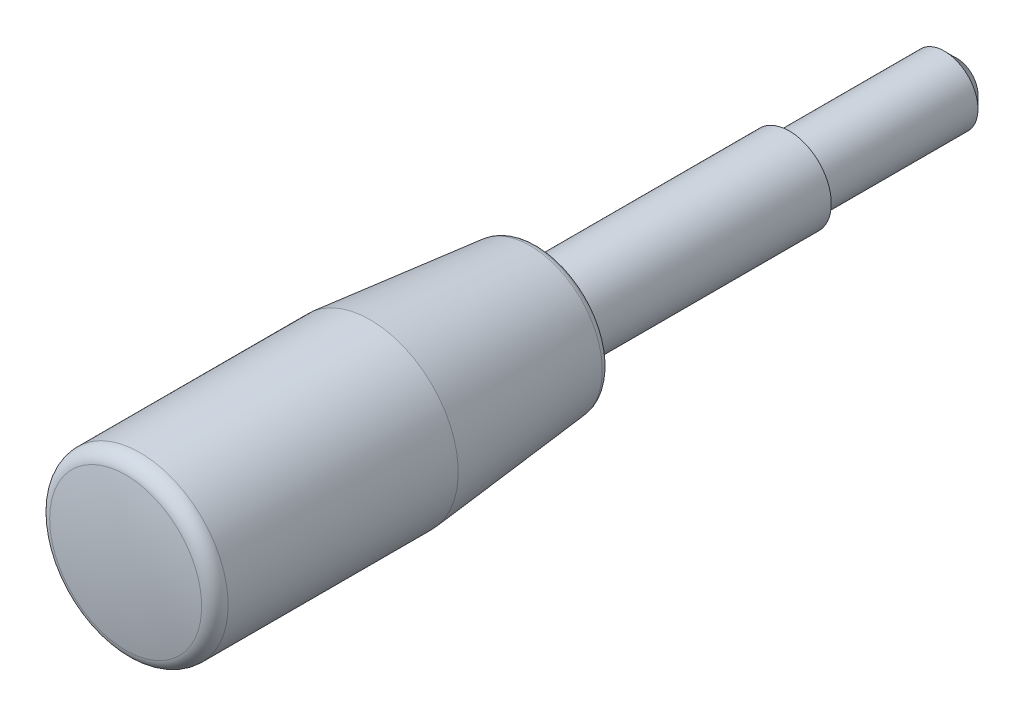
ISO-10303-21;
HEADER;
FILE_DESCRIPTION(('STEP AP214'),'2;1');
FILE_NAME('part.step','',(''),(''),'','','');
FILE_SCHEMA(('AUTOMOTIVE_DESIGN { 1 0 10303 214 1 1 1 1 }'));
ENDSEC;
DATA;
#1=APPLICATION_CONTEXT('core data for automotive mechanical design processes');
#2=APPLICATION_PROTOCOL_DEFINITION('international standard','automotive_design',2000,#1);
#3=PRODUCT_CONTEXT('',#1,'mechanical');
#4=PRODUCT('Part','Part','',(#3));
#5=PRODUCT_RELATED_PRODUCT_CATEGORY('part','',(#4));
#6=PRODUCT_DEFINITION_FORMATION('','',#4);
#7=PRODUCT_DEFINITION_CONTEXT('part definition',#1,'design');
#8=PRODUCT_DEFINITION('design','',#6,#7);
#9=PRODUCT_DEFINITION_SHAPE('','',#8);
#10=(LENGTH_UNIT() NAMED_UNIT(*) SI_UNIT(.MILLI.,.METRE.));
#11=(NAMED_UNIT(*) PLANE_ANGLE_UNIT() SI_UNIT($,.RADIAN.));
#12=(NAMED_UNIT(*) SI_UNIT($,.STERADIAN.) SOLID_ANGLE_UNIT());
#13=UNCERTAINTY_MEASURE_WITH_UNIT(LENGTH_MEASURE(1.E-05),#10,'distance_accuracy_value','');
#14=(GEOMETRIC_REPRESENTATION_CONTEXT(3) GLOBAL_UNCERTAINTY_ASSIGNED_CONTEXT((#13)) GLOBAL_UNIT_ASSIGNED_CONTEXT((#10,
#11,#12)) REPRESENTATION_CONTEXT('',''));
#15=CARTESIAN_POINT('',(0.,0.,0.));
#16=DIRECTION('',(0.,0.,1.));
#17=DIRECTION('',(1.,0.,0.));
#18=AXIS2_PLACEMENT_3D('',#15,#16,#17);
#19=CARTESIAN_POINT('',(0.,0.,-30.9529969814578));
#20=DIRECTION('',(0.,0.,-1.));
#21=DIRECTION('',(-1.,0.,0.));
#22=AXIS2_PLACEMENT_3D('',#19,#20,#21);
#23=CYLINDRICAL_SURFACE('',#22,4.);
#24=CARTESIAN_POINT('',(0.,0.,-18.5));
#25=DIRECTION('',(0.,0.,-1.));
#26=DIRECTION('',(-1.,0.,0.));
#27=AXIS2_PLACEMENT_3D('',#24,#25,#26);
#28=CIRCLE('',#27,4.);
#29=CARTESIAN_POINT('',(-4.,0.,-18.5));
#30=VERTEX_POINT('',#29);
#31=EDGE_CURVE('E8',#30,#30,#28,.T.);
#32=ORIENTED_EDGE('',*,*,#31,.F.);
#33=EDGE_LOOP('',(#32));
#34=FACE_BOUND('',#33,.T.);
#35=CARTESIAN_POINT('',(0.,0.,0.));
#36=DIRECTION('',(0.,0.,-1.));
#37=DIRECTION('',(-1.,0.,0.));
#38=AXIS2_PLACEMENT_3D('',#35,#36,#37);
#39=CIRCLE('',#38,4.);
#40=CARTESIAN_POINT('',(-4.,0.,0.));
#41=VERTEX_POINT('',#40);
#42=EDGE_CURVE('E46',#41,#41,#39,.T.);
#43=ORIENTED_EDGE('',*,*,#42,.T.);
#44=EDGE_LOOP('',(#43));
#45=FACE_BOUND('',#44,.T.);
#46=ADVANCED_FACE('F12',(#34,#45),#23,.T.);
#47=CARTESIAN_POINT('',(0.,0.,-18.5));
#48=DIRECTION('',(0.,0.,1.));
#49=DIRECTION('',(1.,0.,0.));
#50=AXIS2_PLACEMENT_3D('',#47,#48,#49);
#51=CONICAL_SURFACE('',#50,4.,0.785398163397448);
#52=CARTESIAN_POINT('',(0.,0.,-20.));
#53=DIRECTION('',(0.,0.,-1.));
#54=DIRECTION('',(-1.,0.,0.));
#55=AXIS2_PLACEMENT_3D('',#52,#53,#54);
#56=CIRCLE('',#55,2.5);
#57=CARTESIAN_POINT('',(-2.5,0.,-20.));
#58=VERTEX_POINT('',#57);
#59=EDGE_CURVE('E18',#58,#58,#56,.T.);
#60=ORIENTED_EDGE('',*,*,#59,.F.);
#61=EDGE_LOOP('',(#60));
#62=FACE_BOUND('',#61,.T.);
#63=ORIENTED_EDGE('',*,*,#31,.T.);
#64=EDGE_LOOP('',(#63));
#65=FACE_BOUND('',#64,.T.);
#66=ADVANCED_FACE('F102',(#62,#65),#51,.T.);
#67=CARTESIAN_POINT('',(0.,2.49999999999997,-20.));
#68=DIRECTION('',(0.,0.,1.));
#69=DIRECTION('',(1.,0.,0.));
#70=AXIS2_PLACEMENT_3D('',#67,#68,#69);
#71=PLANE('',#70);
#72=ORIENTED_EDGE('',*,*,#59,.T.);
#73=EDGE_LOOP('',(#72));
#74=FACE_BOUND('',#73,.T.);
#75=ADVANCED_FACE('F95',(#74),#71,.F.);
#76=CARTESIAN_POINT('',(0.,0.,30.));
#77=DIRECTION('',(-1.,0.,0.));
#78=DIRECTION('',(0.,0.,1.));
#79=AXIS2_PLACEMENT_3D('',#76,#77,#78);
#80=SPHERICAL_SURFACE('',#79,50.);
#81=CARTESIAN_POINT('',(0.,0.,30.));
#82=DIRECTION('',(0.,0.,-1.));
#83=DIRECTION('',(-1.,0.,0.));
#84=AXIS2_PLACEMENT_3D('',#81,#82,#83);
#85=SPHERICAL_SURFACE('',#84,50.);
#86=CARTESIAN_POINT('',(0.,0.,79.170957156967));
#87=DIRECTION('',(0.,0.,-1.));
#88=DIRECTION('',(-1.,0.,0.));
#89=AXIS2_PLACEMENT_3D('',#86,#87,#88);
#90=CIRCLE('',#89,9.06735751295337);
#91=CARTESIAN_POINT('',(-9.06735751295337,0.,79.170957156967));
#92=VERTEX_POINT('',#91);
#93=EDGE_CURVE('E22',#92,#92,#90,.T.);
#94=ORIENTED_EDGE('',*,*,#93,.F.);
#95=EDGE_LOOP('',(#94));
#96=FACE_BOUND('',#95,.T.);
#97=ADVANCED_FACE('F90',(#96),#85,.T.);
#98=CARTESIAN_POINT('',(0.,0.,77.449973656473));
#99=DIRECTION('',(0.,0.,-1.));
#100=DIRECTION('',(-1.,0.,0.));
#101=AXIS2_PLACEMENT_3D('',#98,#99,#100);
#102=TOROIDAL_SURFACE('',#101,8.75,1.75);
#103=CARTESIAN_POINT('',(0.,0.,77.449973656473));
#104=DIRECTION('',(0.,0.,-1.));
#105=DIRECTION('',(-1.,0.,0.));
#106=AXIS2_PLACEMENT_3D('',#103,#104,#105);
#107=CIRCLE('',#106,10.5);
#108=CARTESIAN_POINT('',(-10.5,0.,77.449973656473));
#109=VERTEX_POINT('',#108);
#110=EDGE_CURVE('E26',#109,#109,#107,.T.);
#111=ORIENTED_EDGE('',*,*,#110,.F.);
#112=EDGE_LOOP('',(#111));
#113=FACE_BOUND('',#112,.T.);
#114=ORIENTED_EDGE('',*,*,#93,.T.);
#115=EDGE_LOOP('',(#114));
#116=FACE_BOUND('',#115,.T.);
#117=ADVANCED_FACE('F84',(#113,#116),#102,.T.);
#118=CARTESIAN_POINT('',(0.,0.,-30.9529969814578));
#119=DIRECTION('',(0.,0.,-1.));
#120=DIRECTION('',(-1.,0.,0.));
#121=AXIS2_PLACEMENT_3D('',#118,#119,#120);
#122=CYLINDRICAL_SURFACE('',#121,10.5);
#123=CARTESIAN_POINT('',(0.,0.,50.));
#124=DIRECTION('',(0.,0.,-1.));
#125=DIRECTION('',(-1.,0.,0.));
#126=AXIS2_PLACEMENT_3D('',#123,#124,#125);
#127=CIRCLE('',#126,10.5);
#128=CARTESIAN_POINT('',(-10.5,0.,50.));
#129=VERTEX_POINT('',#128);
#130=EDGE_CURVE('E31',#129,#129,#127,.T.);
#131=ORIENTED_EDGE('',*,*,#130,.F.);
#132=EDGE_LOOP('',(#131));
#133=FACE_BOUND('',#132,.T.);
#134=ORIENTED_EDGE('',*,*,#110,.T.);
#135=EDGE_LOOP('',(#134));
#136=FACE_BOUND('',#135,.T.);
#137=ADVANCED_FACE('F78',(#133,#136),#122,.T.);
#138=CARTESIAN_POINT('',(0.,0.,50.));
#139=DIRECTION('',(0.,0.,1.));
#140=DIRECTION('',(1.,0.,0.));
#141=AXIS2_PLACEMENT_3D('',#138,#139,#140);
#142=CONICAL_SURFACE('',#141,10.5,0.0996686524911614);
#143=CARTESIAN_POINT('',(0.,0.,30.900496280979));
#144=DIRECTION('',(0.,0.,-1.));
#145=DIRECTION('',(-1.,0.,0.));
#146=AXIS2_PLACEMENT_3D('',#143,#144,#145);
#147=CIRCLE('',#146,8.5900496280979);
#148=CARTESIAN_POINT('',(-8.5900496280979,0.,30.900496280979));
#149=VERTEX_POINT('',#148);
#150=EDGE_CURVE('E34',#149,#149,#147,.T.);
#151=ORIENTED_EDGE('',*,*,#150,.F.);
#152=EDGE_LOOP('',(#151));
#153=FACE_BOUND('',#152,.T.);
#154=ORIENTED_EDGE('',*,*,#130,.T.);
#155=EDGE_LOOP('',(#154));
#156=FACE_BOUND('',#155,.T.);
#157=ADVANCED_FACE('F72',(#153,#156),#142,.T.);
#158=CARTESIAN_POINT('',(0.,0.,31.));
#159=DIRECTION('',(0.,0.,-1.));
#160=DIRECTION('',(-1.,0.,0.));
#161=AXIS2_PLACEMENT_3D('',#158,#159,#160);
#162=TOROIDAL_SURFACE('',#161,7.59501243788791,0.999999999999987);
#163=CARTESIAN_POINT('',(0.,0.,30.));
#164=DIRECTION('',(0.,0.,-1.));
#165=DIRECTION('',(-1.,0.,0.));
#166=AXIS2_PLACEMENT_3D('',#163,#164,#165);
#167=CIRCLE('',#166,7.59501243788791);
#168=CARTESIAN_POINT('',(-7.59501243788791,0.,30.));
#169=VERTEX_POINT('',#168);
#170=EDGE_CURVE('E37',#169,#169,#167,.T.);
#171=ORIENTED_EDGE('',*,*,#170,.F.);
#172=EDGE_LOOP('',(#171));
#173=FACE_BOUND('',#172,.T.);
#174=ORIENTED_EDGE('',*,*,#150,.T.);
#175=EDGE_LOOP('',(#174));
#176=FACE_BOUND('',#175,.T.);
#177=ADVANCED_FACE('F66',(#173,#176),#162,.T.);
#178=CARTESIAN_POINT('',(0.,7.59501243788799,30.));
#179=DIRECTION('',(0.,0.,1.));
#180=DIRECTION('',(1.,0.,0.));
#181=AXIS2_PLACEMENT_3D('',#178,#179,#180);
#182=PLANE('',#181);
#183=CARTESIAN_POINT('',(0.,0.,30.));
#184=DIRECTION('',(0.,0.,-1.));
#185=DIRECTION('',(-1.,0.,0.));
#186=AXIS2_PLACEMENT_3D('',#183,#184,#185);
#187=CIRCLE('',#186,5.);
#188=CARTESIAN_POINT('',(-5.,0.,30.));
#189=VERTEX_POINT('',#188);
#190=EDGE_CURVE('E40',#189,#189,#187,.T.);
#191=ORIENTED_EDGE('',*,*,#190,.F.);
#192=EDGE_LOOP('',(#191));
#193=FACE_BOUND('',#192,.T.);
#194=ORIENTED_EDGE('',*,*,#170,.T.);
#195=EDGE_LOOP('',(#194));
#196=FACE_BOUND('',#195,.T.);
#197=ADVANCED_FACE('F60',(#193,#196),#182,.F.);
#198=CARTESIAN_POINT('',(0.,0.,-30.9529969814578));
#199=DIRECTION('',(0.,0.,-1.));
#200=DIRECTION('',(-1.,0.,0.));
#201=AXIS2_PLACEMENT_3D('',#198,#199,#200);
#202=CYLINDRICAL_SURFACE('',#201,5.);
#203=CARTESIAN_POINT('',(0.,0.,0.));
#204=DIRECTION('',(0.,0.,-1.));
#205=DIRECTION('',(-1.,0.,0.));
#206=AXIS2_PLACEMENT_3D('',#203,#204,#205);
#207=CIRCLE('',#206,5.);
#208=CARTESIAN_POINT('',(-5.,0.,0.));
#209=VERTEX_POINT('',#208);
#210=EDGE_CURVE('E43',#209,#209,#207,.T.);
#211=ORIENTED_EDGE('',*,*,#210,.F.);
#212=EDGE_LOOP('',(#211));
#213=FACE_BOUND('',#212,.T.);
#214=ORIENTED_EDGE('',*,*,#190,.T.);
#215=EDGE_LOOP('',(#214));
#216=FACE_BOUND('',#215,.T.);
#217=ADVANCED_FACE('F54',(#213,#216),#202,.T.);
#218=CARTESIAN_POINT('',(0.,5.,0.));
#219=DIRECTION('',(0.,0.,1.));
#220=DIRECTION('',(1.,0.,0.));
#221=AXIS2_PLACEMENT_3D('',#218,#219,#220);
#222=PLANE('',#221);
#223=ORIENTED_EDGE('',*,*,#42,.F.);
#224=EDGE_LOOP('',(#223));
#225=FACE_BOUND('',#224,.T.);
#226=ORIENTED_EDGE('',*,*,#210,.T.);
#227=EDGE_LOOP('',(#226));
#228=FACE_BOUND('',#227,.T.);
#229=ADVANCED_FACE('F51',(#225,#228),#222,.F.);
#230=CLOSED_SHELL('',(#46,#66,#75,#97,#117,#137,#157,#177,#197,#217,#229));
#231=MANIFOLD_SOLID_BREP('B1',#230);
#232=ADVANCED_BREP_SHAPE_REPRESENTATION('',(#18,#231),#14);
#233=SHAPE_DEFINITION_REPRESENTATION(#9,#232);
ENDSEC;
END-ISO-10303-21;
